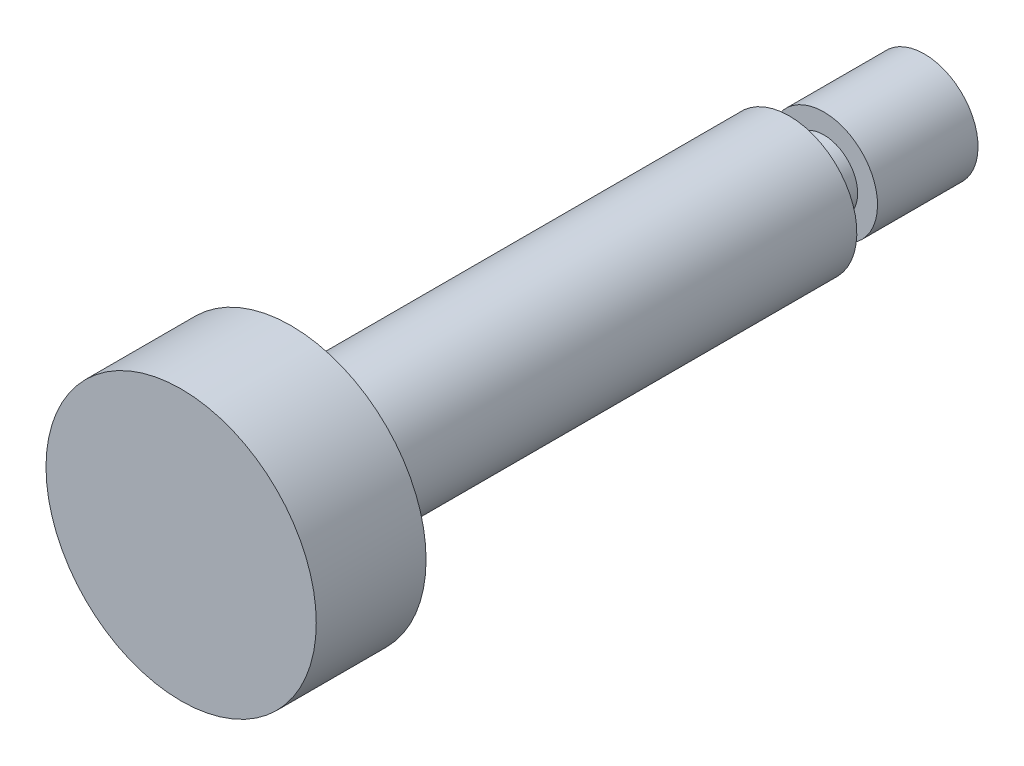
ISO-10303-21;
HEADER;
FILE_DESCRIPTION(('STEP AP214'),'2;1');
FILE_NAME('part.step','',(''),(''),'','','');
FILE_SCHEMA(('AUTOMOTIVE_DESIGN { 1 0 10303 214 1 1 1 1 }'));
ENDSEC;
DATA;
#1=APPLICATION_CONTEXT('core data for automotive mechanical design processes');
#2=APPLICATION_PROTOCOL_DEFINITION('international standard','automotive_design',2000,#1);
#3=PRODUCT_CONTEXT('',#1,'mechanical');
#4=PRODUCT('Part','Part','',(#3));
#5=PRODUCT_RELATED_PRODUCT_CATEGORY('part','',(#4));
#6=PRODUCT_DEFINITION_FORMATION('','',#4);
#7=PRODUCT_DEFINITION_CONTEXT('part definition',#1,'design');
#8=PRODUCT_DEFINITION('design','',#6,#7);
#9=PRODUCT_DEFINITION_SHAPE('','',#8);
#10=(LENGTH_UNIT() NAMED_UNIT(*) SI_UNIT(.MILLI.,.METRE.));
#11=(NAMED_UNIT(*) PLANE_ANGLE_UNIT() SI_UNIT($,.RADIAN.));
#12=(NAMED_UNIT(*) SI_UNIT($,.STERADIAN.) SOLID_ANGLE_UNIT());
#13=UNCERTAINTY_MEASURE_WITH_UNIT(LENGTH_MEASURE(1.E-05),#10,'distance_accuracy_value','');
#14=(GEOMETRIC_REPRESENTATION_CONTEXT(3) GLOBAL_UNCERTAINTY_ASSIGNED_CONTEXT((#13)) GLOBAL_UNIT_ASSIGNED_CONTEXT((#10,
#11,#12)) REPRESENTATION_CONTEXT('',''));
#15=CARTESIAN_POINT('',(0.,0.,0.));
#16=DIRECTION('',(0.,0.,1.));
#17=DIRECTION('',(1.,0.,0.));
#18=AXIS2_PLACEMENT_3D('',#15,#16,#17);
#19=CARTESIAN_POINT('',(0.,-8.,16.));
#20=DIRECTION('',(0.,0.,-1.));
#21=DIRECTION('',(0.,-1.,0.));
#22=AXIS2_PLACEMENT_3D('',#19,#20,#21);
#23=PLANE('',#22);
#24=CARTESIAN_POINT('',(0.,0.,16.));
#25=DIRECTION('',(0.,0.,1.));
#26=DIRECTION('',(0.,1.,0.));
#27=AXIS2_PLACEMENT_3D('',#24,#25,#26);
#28=CIRCLE('',#27,4.);
#29=CARTESIAN_POINT('',(0.,4.,16.));
#30=VERTEX_POINT('',#29);
#31=EDGE_CURVE('E40',#30,#30,#28,.T.);
#32=ORIENTED_EDGE('',*,*,#31,.T.);
#33=EDGE_LOOP('',(#32));
#34=FACE_BOUND('',#33,.T.);
#35=CARTESIAN_POINT('',(0.,0.,16.));
#36=DIRECTION('',(0.,0.,1.));
#37=DIRECTION('',(0.,1.,0.));
#38=AXIS2_PLACEMENT_3D('',#35,#36,#37);
#39=CIRCLE('',#38,8.);
#40=CARTESIAN_POINT('',(0.,8.,16.));
#41=VERTEX_POINT('',#40);
#42=EDGE_CURVE('E8',#41,#41,#39,.T.);
#43=ORIENTED_EDGE('',*,*,#42,.F.);
#44=EDGE_LOOP('',(#43));
#45=FACE_BOUND('',#44,.T.);
#46=ADVANCED_FACE('F12',(#34,#45),#23,.T.);
#47=CARTESIAN_POINT('',(0.,0.,20.));
#48=DIRECTION('',(0.,0.,1.));
#49=DIRECTION('',(0.,1.,0.));
#50=AXIS2_PLACEMENT_3D('',#47,#48,#49);
#51=CYLINDRICAL_SURFACE('',#50,8.);
#52=CARTESIAN_POINT('',(0.,0.,75.));
#53=DIRECTION('',(0.,0.,1.));
#54=DIRECTION('',(0.,1.,0.));
#55=AXIS2_PLACEMENT_3D('',#52,#53,#54);
#56=CIRCLE('',#55,8.);
#57=CARTESIAN_POINT('',(0.,8.,75.));
#58=VERTEX_POINT('',#57);
#59=EDGE_CURVE('E18',#58,#58,#56,.T.);
#60=ORIENTED_EDGE('',*,*,#59,.F.);
#61=EDGE_LOOP('',(#60));
#62=FACE_BOUND('',#61,.T.);
#63=ORIENTED_EDGE('',*,*,#42,.T.);
#64=EDGE_LOOP('',(#63));
#65=FACE_BOUND('',#64,.T.);
#66=ADVANCED_FACE('F59',(#62,#65),#51,.T.);
#67=CARTESIAN_POINT('',(0.,-16.,75.));
#68=DIRECTION('',(0.,0.,-1.));
#69=DIRECTION('',(0.,-1.,0.));
#70=AXIS2_PLACEMENT_3D('',#67,#68,#69);
#71=PLANE('',#70);
#72=ORIENTED_EDGE('',*,*,#59,.T.);
#73=EDGE_LOOP('',(#72));
#74=FACE_BOUND('',#73,.T.);
#75=CARTESIAN_POINT('',(0.,0.,75.));
#76=DIRECTION('',(0.,0.,1.));
#77=DIRECTION('',(0.,1.,0.));
#78=AXIS2_PLACEMENT_3D('',#75,#76,#77);
#79=CIRCLE('',#78,16.);
#80=CARTESIAN_POINT('',(0.,16.,75.));
#81=VERTEX_POINT('',#80);
#82=EDGE_CURVE('E22',#81,#81,#79,.T.);
#83=ORIENTED_EDGE('',*,*,#82,.F.);
#84=EDGE_LOOP('',(#83));
#85=FACE_BOUND('',#84,.T.);
#86=ADVANCED_FACE('F63',(#74,#85),#71,.T.);
#87=CARTESIAN_POINT('',(0.,0.,20.));
#88=DIRECTION('',(0.,0.,1.));
#89=DIRECTION('',(0.,1.,0.));
#90=AXIS2_PLACEMENT_3D('',#87,#88,#89);
#91=CYLINDRICAL_SURFACE('',#90,16.);
#92=CARTESIAN_POINT('',(0.,0.,88.));
#93=DIRECTION('',(0.,0.,1.));
#94=DIRECTION('',(0.,1.,0.));
#95=AXIS2_PLACEMENT_3D('',#92,#93,#94);
#96=CIRCLE('',#95,16.);
#97=CARTESIAN_POINT('',(0.,16.,88.));
#98=VERTEX_POINT('',#97);
#99=EDGE_CURVE('E26',#98,#98,#96,.T.);
#100=ORIENTED_EDGE('',*,*,#99,.F.);
#101=EDGE_LOOP('',(#100));
#102=FACE_BOUND('',#101,.T.);
#103=ORIENTED_EDGE('',*,*,#82,.T.);
#104=EDGE_LOOP('',(#103));
#105=FACE_BOUND('',#104,.T.);
#106=ADVANCED_FACE('F68',(#102,#105),#91,.T.);
#107=CARTESIAN_POINT('',(0.,-16.,88.));
#108=DIRECTION('',(0.,0.,-1.));
#109=DIRECTION('',(0.,-1.,0.));
#110=AXIS2_PLACEMENT_3D('',#107,#108,#109);
#111=PLANE('',#110);
#112=ORIENTED_EDGE('',*,*,#99,.T.);
#113=EDGE_LOOP('',(#112));
#114=FACE_BOUND('',#113,.T.);
#115=ADVANCED_FACE('F73',(#114),#111,.F.);
#116=CARTESIAN_POINT('',(0.,-6.35,0.));
#117=DIRECTION('',(0.,0.,-1.));
#118=DIRECTION('',(0.,-1.,0.));
#119=AXIS2_PLACEMENT_3D('',#116,#117,#118);
#120=PLANE('',#119);
#121=CARTESIAN_POINT('',(0.,0.,0.));
#122=DIRECTION('',(0.,0.,1.));
#123=DIRECTION('',(0.,1.,0.));
#124=AXIS2_PLACEMENT_3D('',#121,#122,#123);
#125=CIRCLE('',#124,6.35);
#126=CARTESIAN_POINT('',(0.,6.35,0.));
#127=VERTEX_POINT('',#126);
#128=EDGE_CURVE('E31',#127,#127,#125,.T.);
#129=ORIENTED_EDGE('',*,*,#128,.F.);
#130=EDGE_LOOP('',(#129));
#131=FACE_BOUND('',#130,.T.);
#132=ADVANCED_FACE('F77',(#131),#120,.T.);
#133=CARTESIAN_POINT('',(0.,0.,20.));
#134=DIRECTION('',(0.,0.,1.));
#135=DIRECTION('',(0.,1.,0.));
#136=AXIS2_PLACEMENT_3D('',#133,#134,#135);
#137=CYLINDRICAL_SURFACE('',#136,6.35);
#138=ORIENTED_EDGE('',*,*,#128,.T.);
#139=EDGE_LOOP('',(#138));
#140=FACE_BOUND('',#139,.T.);
#141=CARTESIAN_POINT('',(0.,0.,11.9));
#142=DIRECTION('',(0.,0.,1.));
#143=DIRECTION('',(0.,1.,0.));
#144=AXIS2_PLACEMENT_3D('',#141,#142,#143);
#145=CIRCLE('',#144,6.35);
#146=CARTESIAN_POINT('',(0.,6.35,11.9));
#147=VERTEX_POINT('',#146);
#148=EDGE_CURVE('E34',#147,#147,#145,.T.);
#149=ORIENTED_EDGE('',*,*,#148,.F.);
#150=EDGE_LOOP('',(#149));
#151=FACE_BOUND('',#150,.T.);
#152=ADVANCED_FACE('F55',(#140,#151),#137,.T.);
#153=CARTESIAN_POINT('',(0.,-4.,11.9));
#154=DIRECTION('',(0.,0.,1.));
#155=DIRECTION('',(0.,1.,0.));
#156=AXIS2_PLACEMENT_3D('',#153,#154,#155);
#157=PLANE('',#156);
#158=ORIENTED_EDGE('',*,*,#148,.T.);
#159=EDGE_LOOP('',(#158));
#160=FACE_BOUND('',#159,.T.);
#161=CARTESIAN_POINT('',(0.,0.,11.9));
#162=DIRECTION('',(0.,0.,1.));
#163=DIRECTION('',(0.,1.,0.));
#164=AXIS2_PLACEMENT_3D('',#161,#162,#163);
#165=CIRCLE('',#164,4.);
#166=CARTESIAN_POINT('',(0.,4.,11.9));
#167=VERTEX_POINT('',#166);
#168=EDGE_CURVE('E37',#167,#167,#165,.T.);
#169=ORIENTED_EDGE('',*,*,#168,.F.);
#170=EDGE_LOOP('',(#169));
#171=FACE_BOUND('',#170,.T.);
#172=ADVANCED_FACE('F48',(#160,#171),#157,.T.);
#173=CARTESIAN_POINT('',(0.,0.,20.));
#174=DIRECTION('',(0.,0.,1.));
#175=DIRECTION('',(0.,1.,0.));
#176=AXIS2_PLACEMENT_3D('',#173,#174,#175);
#177=CYLINDRICAL_SURFACE('',#176,4.);
#178=ORIENTED_EDGE('',*,*,#168,.T.);
#179=EDGE_LOOP('',(#178));
#180=FACE_BOUND('',#179,.T.);
#181=ORIENTED_EDGE('',*,*,#31,.F.);
#182=EDGE_LOOP('',(#181));
#183=FACE_BOUND('',#182,.T.);
#184=ADVANCED_FACE('F46',(#180,#183),#177,.T.);
#185=CLOSED_SHELL('',(#46,#66,#86,#106,#115,#132,#152,#172,#184));
#186=MANIFOLD_SOLID_BREP('B1',#185);
#187=ADVANCED_BREP_SHAPE_REPRESENTATION('',(#18,#186),#14);
#188=SHAPE_DEFINITION_REPRESENTATION(#9,#187);
ENDSEC;
END-ISO-10303-21;
